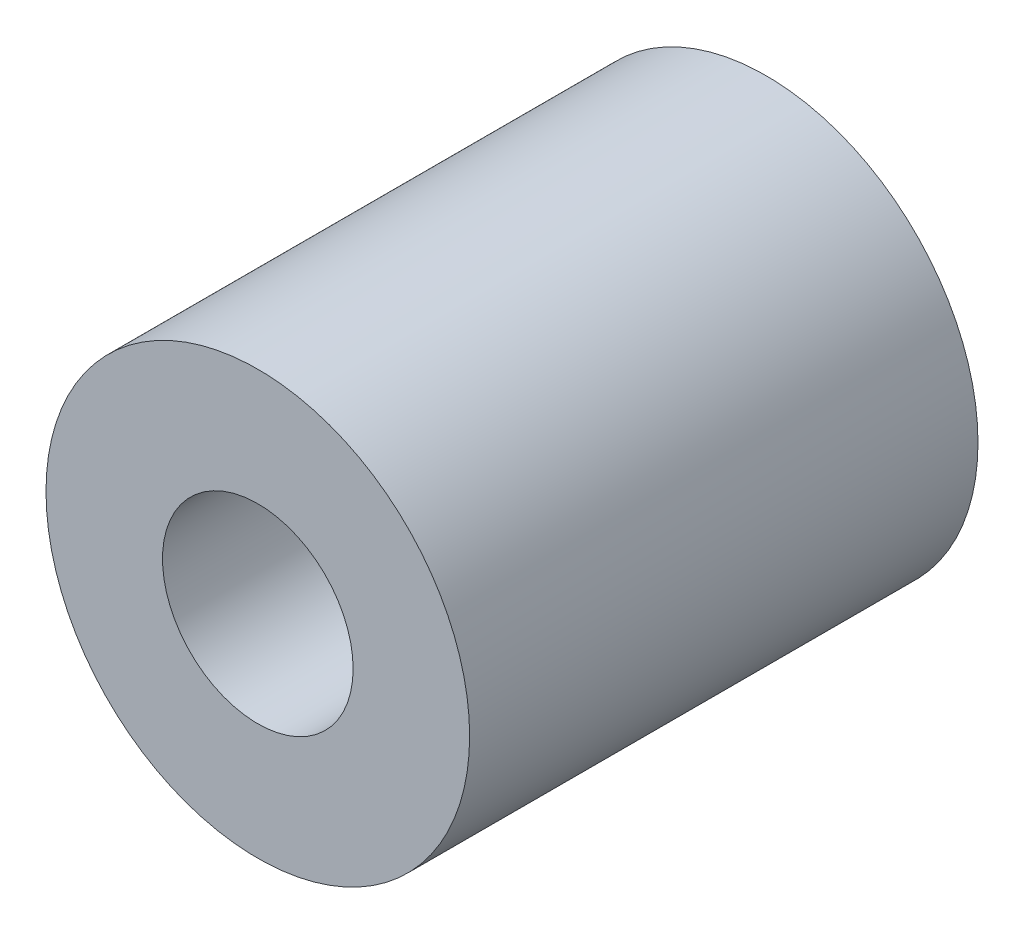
ISO-10303-21;
HEADER;
FILE_DESCRIPTION(('STEP AP214'),'2;1');
FILE_NAME('part.step','',(''),(''),'','','');
FILE_SCHEMA(('AUTOMOTIVE_DESIGN { 1 0 10303 214 1 1 1 1 }'));
ENDSEC;
DATA;
#1=APPLICATION_CONTEXT('core data for automotive mechanical design processes');
#2=APPLICATION_PROTOCOL_DEFINITION('international standard','automotive_design',2000,#1);
#3=PRODUCT_CONTEXT('',#1,'mechanical');
#4=PRODUCT('Part','Part','',(#3));
#5=PRODUCT_RELATED_PRODUCT_CATEGORY('part','',(#4));
#6=PRODUCT_DEFINITION_FORMATION('','',#4);
#7=PRODUCT_DEFINITION_CONTEXT('part definition',#1,'design');
#8=PRODUCT_DEFINITION('design','',#6,#7);
#9=PRODUCT_DEFINITION_SHAPE('','',#8);
#10=(LENGTH_UNIT() NAMED_UNIT(*) SI_UNIT(.MILLI.,.METRE.));
#11=(NAMED_UNIT(*) PLANE_ANGLE_UNIT() SI_UNIT($,.RADIAN.));
#12=(NAMED_UNIT(*) SI_UNIT($,.STERADIAN.) SOLID_ANGLE_UNIT());
#13=UNCERTAINTY_MEASURE_WITH_UNIT(LENGTH_MEASURE(1.E-05),#10,'distance_accuracy_value','');
#14=(GEOMETRIC_REPRESENTATION_CONTEXT(3) GLOBAL_UNCERTAINTY_ASSIGNED_CONTEXT((#13)) GLOBAL_UNIT_ASSIGNED_CONTEXT((#10,
#11,#12)) REPRESENTATION_CONTEXT('',''));
#15=CARTESIAN_POINT('',(0.,0.,0.));
#16=DIRECTION('',(0.,0.,1.));
#17=DIRECTION('',(1.,0.,0.));
#18=AXIS2_PLACEMENT_3D('',#15,#16,#17);
#19=CARTESIAN_POINT('',(0.,0.,12.));
#20=DIRECTION('',(0.,0.,1.));
#21=DIRECTION('',(1.,0.,0.));
#22=AXIS2_PLACEMENT_3D('',#19,#20,#21);
#23=PLANE('',#22);
#24=CARTESIAN_POINT('',(0.,0.,12.));
#25=DIRECTION('',(0.,0.,1.));
#26=DIRECTION('',(1.,0.,0.));
#27=AXIS2_PLACEMENT_3D('',#24,#25,#26);
#28=CIRCLE('',#27,5.);
#29=CARTESIAN_POINT('',(5.,0.,12.));
#30=VERTEX_POINT('',#29);
#31=EDGE_CURVE('E10',#30,#30,#28,.T.);
#32=ORIENTED_EDGE('',*,*,#31,.T.);
#33=EDGE_LOOP('',(#32));
#34=FACE_BOUND('',#33,.T.);
#35=CARTESIAN_POINT('',(0.,0.,12.));
#36=DIRECTION('',(0.,0.,1.));
#37=DIRECTION('',(1.,0.,0.));
#38=AXIS2_PLACEMENT_3D('',#35,#36,#37);
#39=CIRCLE('',#38,2.25);
#40=CARTESIAN_POINT('',(2.25,0.,12.));
#41=VERTEX_POINT('',#40);
#42=EDGE_CURVE('E40',#41,#41,#39,.T.);
#43=ORIENTED_EDGE('',*,*,#42,.F.);
#44=EDGE_LOOP('',(#43));
#45=FACE_BOUND('',#44,.T.);
#46=ADVANCED_FACE('F29',(#34,#45),#23,.T.);
#47=CARTESIAN_POINT('',(0.,0.,0.));
#48=DIRECTION('',(0.,0.,1.));
#49=DIRECTION('',(1.,0.,0.));
#50=AXIS2_PLACEMENT_3D('',#47,#48,#49);
#51=PLANE('',#50);
#52=CARTESIAN_POINT('',(0.,0.,0.));
#53=DIRECTION('',(0.,0.,1.));
#54=DIRECTION('',(1.,0.,0.));
#55=AXIS2_PLACEMENT_3D('',#52,#53,#54);
#56=CIRCLE('',#55,5.);
#57=CARTESIAN_POINT('',(5.,0.,0.));
#58=VERTEX_POINT('',#57);
#59=EDGE_CURVE('E33',#58,#58,#56,.T.);
#60=ORIENTED_EDGE('',*,*,#59,.F.);
#61=EDGE_LOOP('',(#60));
#62=FACE_BOUND('',#61,.T.);
#63=CARTESIAN_POINT('',(0.,0.,0.));
#64=DIRECTION('',(0.,0.,1.));
#65=DIRECTION('',(1.,0.,0.));
#66=AXIS2_PLACEMENT_3D('',#63,#64,#65);
#67=CIRCLE('',#66,2.25);
#68=CARTESIAN_POINT('',(2.25,0.,0.));
#69=VERTEX_POINT('',#68);
#70=EDGE_CURVE('E42',#69,#69,#67,.T.);
#71=ORIENTED_EDGE('',*,*,#70,.T.);
#72=EDGE_LOOP('',(#71));
#73=FACE_BOUND('',#72,.T.);
#74=ADVANCED_FACE('F52',(#62,#73),#51,.F.);
#75=CARTESIAN_POINT('',(0.,0.,12.));
#76=DIRECTION('',(0.,0.,-1.));
#77=DIRECTION('',(-1.,0.,0.));
#78=AXIS2_PLACEMENT_3D('',#75,#76,#77);
#79=CYLINDRICAL_SURFACE('',#78,5.);
#80=ORIENTED_EDGE('',*,*,#31,.F.);
#81=EDGE_LOOP('',(#80));
#82=FACE_BOUND('',#81,.T.);
#83=ORIENTED_EDGE('',*,*,#59,.T.);
#84=EDGE_LOOP('',(#83));
#85=FACE_BOUND('',#84,.T.);
#86=ADVANCED_FACE('F31',(#82,#85),#79,.T.);
#87=CARTESIAN_POINT('',(0.,0.,12.));
#88=DIRECTION('',(0.,0.,-1.));
#89=DIRECTION('',(-1.,0.,0.));
#90=AXIS2_PLACEMENT_3D('',#87,#88,#89);
#91=CYLINDRICAL_SURFACE('',#90,2.25);
#92=ORIENTED_EDGE('',*,*,#42,.T.);
#93=EDGE_LOOP('',(#92));
#94=FACE_BOUND('',#93,.T.);
#95=ORIENTED_EDGE('',*,*,#70,.F.);
#96=EDGE_LOOP('',(#95));
#97=FACE_BOUND('',#96,.T.);
#98=ADVANCED_FACE('F48',(#94,#97),#91,.F.);
#99=CLOSED_SHELL('',(#46,#74,#86,#98));
#100=MANIFOLD_SOLID_BREP('B2',#99);
#101=ADVANCED_BREP_SHAPE_REPRESENTATION('',(#18,#100),#14);
#102=SHAPE_DEFINITION_REPRESENTATION(#9,#101);
ENDSEC;
END-ISO-10303-21;
